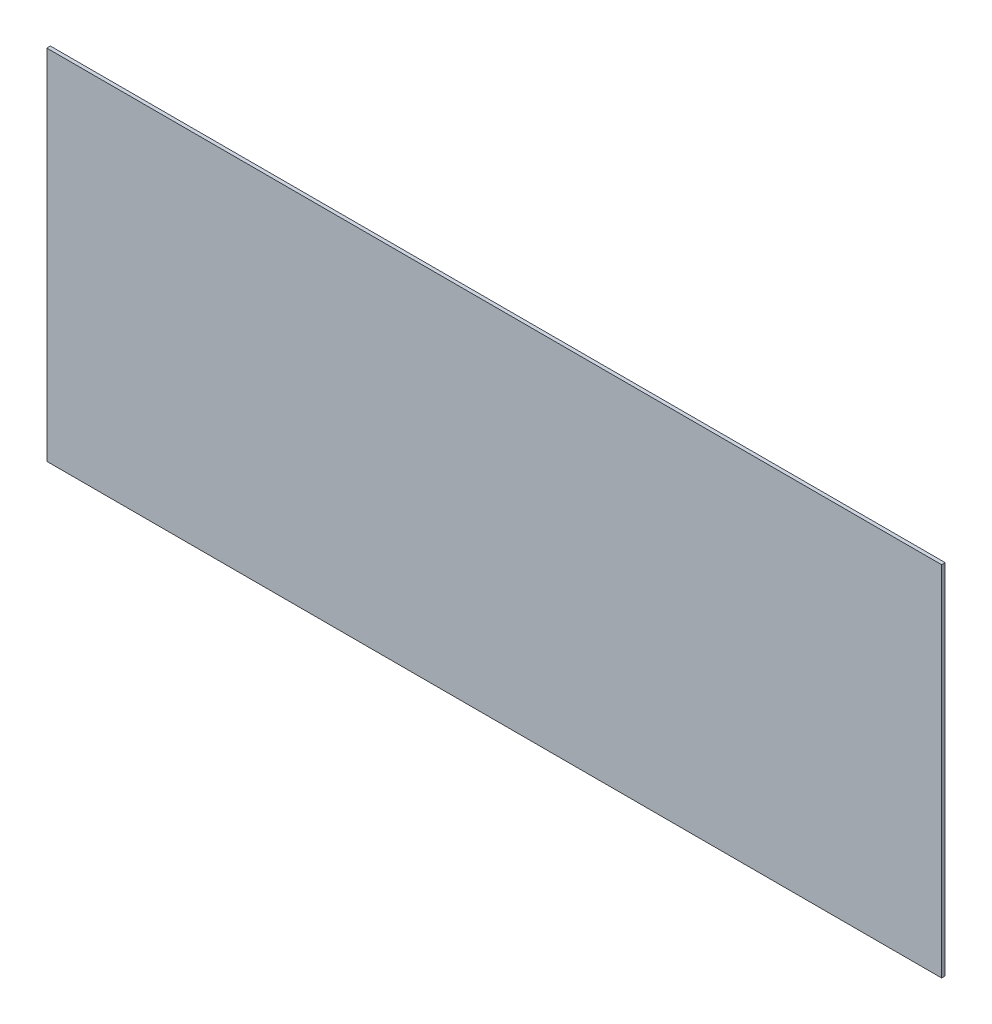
from build123d import *

# Parameters (mm, degrees)
SKETCH1_W           = 250
SKETCH1_H           = 100
BOSS_EXTRUDE1_DEPTH = 1


with BuildPart() as part:
    # Sketch1 → Boss-Extrude1 (new body)
    with BuildSketch(Plane.XY):
        Rectangle(SKETCH1_W, SKETCH1_H)
    extrude(amount=BOSS_EXTRUDE1_DEPTH)


solid = part.part
